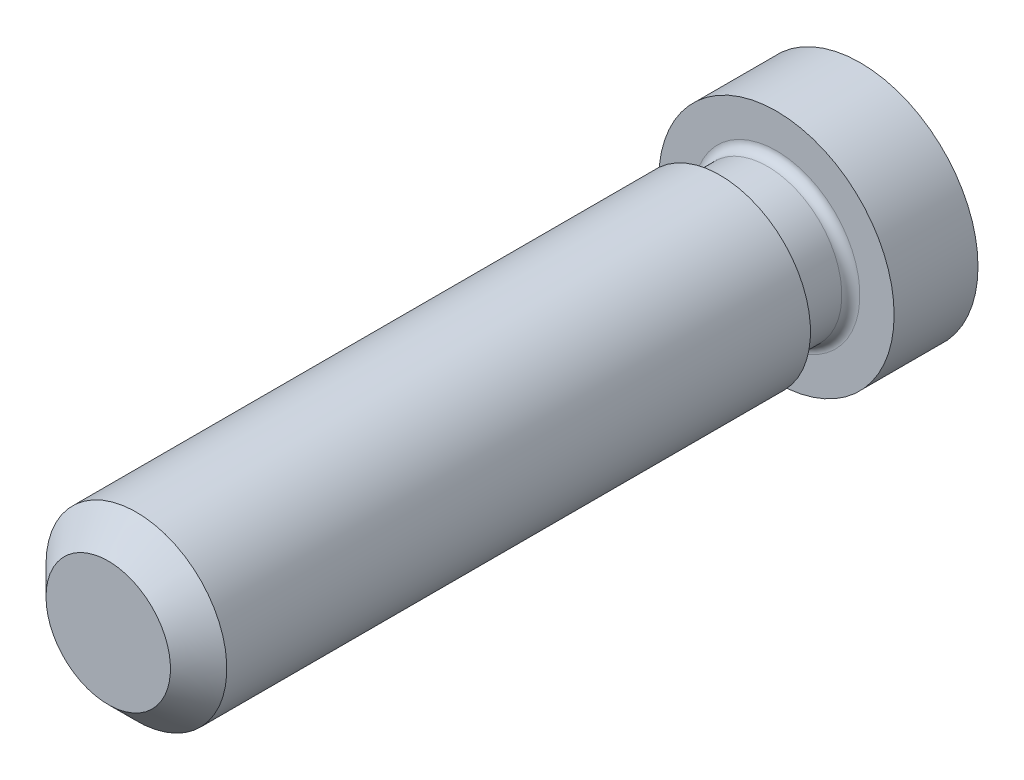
ISO-10303-21;
HEADER;
FILE_DESCRIPTION(('STEP AP214'),'2;1');
FILE_NAME('part.step','',(''),(''),'','','');
FILE_SCHEMA(('AUTOMOTIVE_DESIGN { 1 0 10303 214 1 1 1 1 }'));
ENDSEC;
DATA;
#1=APPLICATION_CONTEXT('core data for automotive mechanical design processes');
#2=APPLICATION_PROTOCOL_DEFINITION('international standard','automotive_design',2000,#1);
#3=PRODUCT_CONTEXT('',#1,'mechanical');
#4=PRODUCT('Part','Part','',(#3));
#5=PRODUCT_RELATED_PRODUCT_CATEGORY('part','',(#4));
#6=PRODUCT_DEFINITION_FORMATION('','',#4);
#7=PRODUCT_DEFINITION_CONTEXT('part definition',#1,'design');
#8=PRODUCT_DEFINITION('design','',#6,#7);
#9=PRODUCT_DEFINITION_SHAPE('','',#8);
#10=(LENGTH_UNIT() NAMED_UNIT(*) SI_UNIT(.MILLI.,.METRE.));
#11=(NAMED_UNIT(*) PLANE_ANGLE_UNIT() SI_UNIT($,.RADIAN.));
#12=(NAMED_UNIT(*) SI_UNIT($,.STERADIAN.) SOLID_ANGLE_UNIT());
#13=UNCERTAINTY_MEASURE_WITH_UNIT(LENGTH_MEASURE(1.E-05),#10,'distance_accuracy_value','');
#14=(GEOMETRIC_REPRESENTATION_CONTEXT(3) GLOBAL_UNCERTAINTY_ASSIGNED_CONTEXT((#13)) GLOBAL_UNIT_ASSIGNED_CONTEXT((#10,
#11,#12)) REPRESENTATION_CONTEXT('',''));
#15=CARTESIAN_POINT('',(0.,0.,0.));
#16=DIRECTION('',(0.,0.,1.));
#17=DIRECTION('',(1.,0.,0.));
#18=AXIS2_PLACEMENT_3D('',#15,#16,#17);
#19=CARTESIAN_POINT('',(0.,1.7526,21.1836));
#20=DIRECTION('',(0.,0.,1.));
#21=DIRECTION('',(1.,0.,0.));
#22=AXIS2_PLACEMENT_3D('',#19,#20,#21);
#23=PLANE('',#22);
#24=CARTESIAN_POINT('',(0.,0.,21.1836));
#25=DIRECTION('',(0.,0.,-1.));
#26=DIRECTION('',(-1.,0.,0.));
#27=AXIS2_PLACEMENT_3D('',#24,#25,#26);
#28=CIRCLE('',#27,1.7526);
#29=CARTESIAN_POINT('',(-1.7526,0.,21.1836));
#30=VERTEX_POINT('',#29);
#31=EDGE_CURVE('E10',#30,#30,#28,.T.);
#32=ORIENTED_EDGE('',*,*,#31,.F.);
#33=EDGE_LOOP('',(#32));
#34=FACE_BOUND('',#33,.T.);
#35=ADVANCED_FACE('F33',(#34),#23,.T.);
#36=CARTESIAN_POINT('',(0.,0.,20.38985));
#37=DIRECTION('',(0.,0.,-1.));
#38=DIRECTION('',(-1.,0.,0.));
#39=AXIS2_PLACEMENT_3D('',#36,#37,#38);
#40=CONICAL_SURFACE('',#39,2.54635,0.785398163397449);
#41=ORIENTED_EDGE('',*,*,#31,.T.);
#42=EDGE_LOOP('',(#41));
#43=FACE_BOUND('',#42,.T.);
#44=CARTESIAN_POINT('',(0.,0.,20.38985));
#45=DIRECTION('',(0.,0.,-1.));
#46=DIRECTION('',(-1.,0.,0.));
#47=AXIS2_PLACEMENT_3D('',#44,#45,#46);
#48=CIRCLE('',#47,2.54635);
#49=CARTESIAN_POINT('',(-2.54635,0.,20.38985));
#50=VERTEX_POINT('',#49);
#51=EDGE_CURVE('E39',#50,#50,#48,.T.);
#52=ORIENTED_EDGE('',*,*,#51,.F.);
#53=EDGE_LOOP('',(#52));
#54=FACE_BOUND('',#53,.T.);
#55=ADVANCED_FACE('F81',(#43,#54),#40,.T.);
#56=CARTESIAN_POINT('',(0.,0.,0.));
#57=DIRECTION('',(0.,0.,-1.));
#58=DIRECTION('',(-1.,0.,0.));
#59=AXIS2_PLACEMENT_3D('',#56,#57,#58);
#60=CYLINDRICAL_SURFACE('',#59,2.54635);
#61=ORIENTED_EDGE('',*,*,#51,.T.);
#62=EDGE_LOOP('',(#61));
#63=FACE_BOUND('',#62,.T.);
#64=CARTESIAN_POINT('',(0.,0.,3.9497));
#65=DIRECTION('',(0.,0.,-1.));
#66=DIRECTION('',(-1.,0.,0.));
#67=AXIS2_PLACEMENT_3D('',#64,#65,#66);
#68=CIRCLE('',#67,2.54635);
#69=CARTESIAN_POINT('',(-2.54635,0.,3.9497));
#70=VERTEX_POINT('',#69);
#71=EDGE_CURVE('E43',#70,#70,#68,.T.);
#72=ORIENTED_EDGE('',*,*,#71,.F.);
#73=EDGE_LOOP('',(#72));
#74=FACE_BOUND('',#73,.T.);
#75=ADVANCED_FACE('F86',(#63,#74),#60,.T.);
#76=CARTESIAN_POINT('',(0.,2.0955,3.9497));
#77=DIRECTION('',(0.,0.,-1.));
#78=DIRECTION('',(-1.,0.,0.));
#79=AXIS2_PLACEMENT_3D('',#76,#77,#78);
#80=PLANE('',#79);
#81=ORIENTED_EDGE('',*,*,#71,.T.);
#82=EDGE_LOOP('',(#81));
#83=FACE_BOUND('',#82,.T.);
#84=CARTESIAN_POINT('',(0.,0.,3.9497));
#85=DIRECTION('',(0.,0.,-1.));
#86=DIRECTION('',(-1.,0.,0.));
#87=AXIS2_PLACEMENT_3D('',#84,#85,#86);
#88=CIRCLE('',#87,2.0955);
#89=CARTESIAN_POINT('',(-2.0955,0.,3.9497));
#90=VERTEX_POINT('',#89);
#91=EDGE_CURVE('E47',#90,#90,#88,.T.);
#92=ORIENTED_EDGE('',*,*,#91,.F.);
#93=EDGE_LOOP('',(#92));
#94=FACE_BOUND('',#93,.T.);
#95=ADVANCED_FACE('F90',(#83,#94),#80,.T.);
#96=CARTESIAN_POINT('',(0.,0.,0.));
#97=DIRECTION('',(0.,0.,-1.));
#98=DIRECTION('',(-1.,0.,0.));
#99=AXIS2_PLACEMENT_3D('',#96,#97,#98);
#100=CYLINDRICAL_SURFACE('',#99,2.0955);
#101=ORIENTED_EDGE('',*,*,#91,.T.);
#102=EDGE_LOOP('',(#101));
#103=FACE_BOUND('',#102,.T.);
#104=CARTESIAN_POINT('',(0.,0.,2.6162));
#105=DIRECTION('',(0.,0.,-1.));
#106=DIRECTION('',(-1.,0.,0.));
#107=AXIS2_PLACEMENT_3D('',#104,#105,#106);
#108=CIRCLE('',#107,2.0955);
#109=CARTESIAN_POINT('',(-2.0955,0.,2.6162));
#110=VERTEX_POINT('',#109);
#111=EDGE_CURVE('E52',#110,#110,#108,.T.);
#112=ORIENTED_EDGE('',*,*,#111,.F.);
#113=EDGE_LOOP('',(#112));
#114=FACE_BOUND('',#113,.T.);
#115=ADVANCED_FACE('F96',(#103,#114),#100,.T.);
#116=CARTESIAN_POINT('',(0.,0.,2.6162));
#117=DIRECTION('',(0.,0.,-1.));
#118=DIRECTION('',(-1.,0.,0.));
#119=AXIS2_PLACEMENT_3D('',#116,#117,#118);
#120=TOROIDAL_SURFACE('',#119,2.3495,0.254);
#121=ORIENTED_EDGE('',*,*,#111,.T.);
#122=EDGE_LOOP('',(#121));
#123=FACE_BOUND('',#122,.T.);
#124=CARTESIAN_POINT('',(0.,0.,2.3622));
#125=DIRECTION('',(0.,0.,-1.));
#126=DIRECTION('',(-1.,0.,0.));
#127=AXIS2_PLACEMENT_3D('',#124,#125,#126);
#128=CIRCLE('',#127,2.3495);
#129=CARTESIAN_POINT('',(-2.3495,0.,2.3622));
#130=VERTEX_POINT('',#129);
#131=EDGE_CURVE('E55',#130,#130,#128,.T.);
#132=ORIENTED_EDGE('',*,*,#131,.F.);
#133=EDGE_LOOP('',(#132));
#134=FACE_BOUND('',#133,.T.);
#135=ADVANCED_FACE('F77',(#123,#134),#120,.F.);
#136=CARTESIAN_POINT('',(0.,3.3147,2.3622));
#137=DIRECTION('',(0.,0.,1.));
#138=DIRECTION('',(1.,0.,0.));
#139=AXIS2_PLACEMENT_3D('',#136,#137,#138);
#140=PLANE('',#139);
#141=ORIENTED_EDGE('',*,*,#131,.T.);
#142=EDGE_LOOP('',(#141));
#143=FACE_BOUND('',#142,.T.);
#144=CARTESIAN_POINT('',(0.,0.,2.3622));
#145=DIRECTION('',(0.,0.,-1.));
#146=DIRECTION('',(-1.,0.,0.));
#147=AXIS2_PLACEMENT_3D('',#144,#145,#146);
#148=CIRCLE('',#147,3.3147);
#149=CARTESIAN_POINT('',(-3.3147,0.,2.3622));
#150=VERTEX_POINT('',#149);
#151=EDGE_CURVE('E58',#150,#150,#148,.T.);
#152=ORIENTED_EDGE('',*,*,#151,.F.);
#153=EDGE_LOOP('',(#152));
#154=FACE_BOUND('',#153,.T.);
#155=ADVANCED_FACE('F69',(#143,#154),#140,.T.);
#156=CARTESIAN_POINT('',(0.,0.,0.));
#157=DIRECTION('',(0.,0.,-1.));
#158=DIRECTION('',(-1.,0.,0.));
#159=AXIS2_PLACEMENT_3D('',#156,#157,#158);
#160=CYLINDRICAL_SURFACE('',#159,3.3147);
#161=ORIENTED_EDGE('',*,*,#151,.T.);
#162=EDGE_LOOP('',(#161));
#163=FACE_BOUND('',#162,.T.);
#164=CARTESIAN_POINT('',(0.,0.,0.));
#165=DIRECTION('',(0.,0.,-1.));
#166=DIRECTION('',(-1.,0.,0.));
#167=AXIS2_PLACEMENT_3D('',#164,#165,#166);
#168=CIRCLE('',#167,3.3147);
#169=CARTESIAN_POINT('',(-3.3147,0.,0.));
#170=VERTEX_POINT('',#169);
#171=EDGE_CURVE('E61',#170,#170,#168,.T.);
#172=ORIENTED_EDGE('',*,*,#171,.F.);
#173=EDGE_LOOP('',(#172));
#174=FACE_BOUND('',#173,.T.);
#175=ADVANCED_FACE('F67',(#163,#174),#160,.T.);
#176=CARTESIAN_POINT('',(0.,0.,0.));
#177=DIRECTION('',(0.,0.,-1.));
#178=DIRECTION('',(-1.,0.,0.));
#179=AXIS2_PLACEMENT_3D('',#176,#177,#178);
#180=PLANE('',#179);
#181=ORIENTED_EDGE('',*,*,#171,.T.);
#182=EDGE_LOOP('',(#181));
#183=FACE_BOUND('',#182,.T.);
#184=ADVANCED_FACE('F65',(#183),#180,.T.);
#185=CLOSED_SHELL('',(#35,#55,#75,#95,#115,#135,#155,#175,#184));
#186=MANIFOLD_SOLID_BREP('B2',#185);
#187=ADVANCED_BREP_SHAPE_REPRESENTATION('',(#18,#186),#14);
#188=SHAPE_DEFINITION_REPRESENTATION(#9,#187);
ENDSEC;
END-ISO-10303-21;
